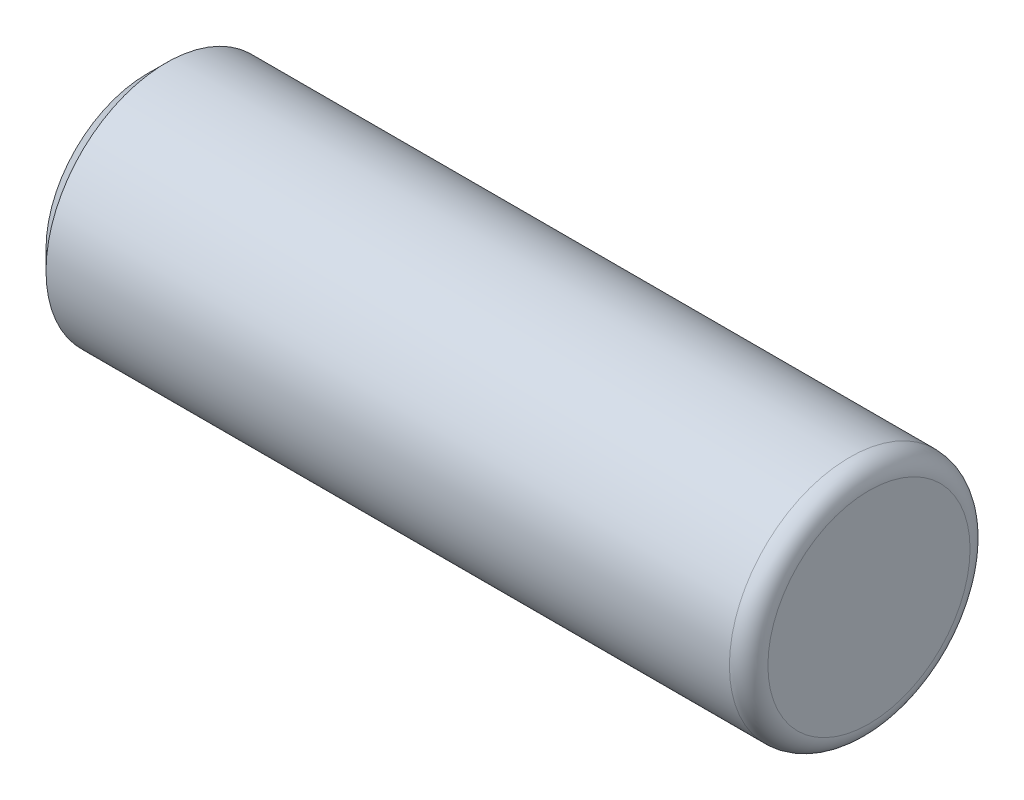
from build123d import *

# Parameters (mm, degrees)
SKETCH2_W     = 19.05
SKETCH2_H     = 3.175
CHAMFER1_SIZE = 0.508
FILLET1_R     = 0.508


with BuildPart() as part:
    # Sketch2 → Revolve1 (revolve)
    with BuildSketch(Plane.XY, mode=Mode.PRIVATE) as revolve1_sk:
        with Locations((-9.525, 1.5875)):
            Rectangle(SKETCH2_W, SKETCH2_H)
    revolve(revolve1_sk.sketch.rotate(Axis((-14.156533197, 0, 0), (1, 0, 0)), 90), axis=Axis((-14.156533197, 0, 0), (1, 0, 0)))

    # Chamfer1
    chamfer1_edges = [part.edges().sort_by_distance(p)[0] for p in [
        (-19.05, 0, -3.175),
    ]]
    chamfer(chamfer1_edges, length=CHAMFER1_SIZE)

    # Fillet1
    fillet1_edges = [part.edges().sort_by_distance(p)[0] for p in [
        (0, 0, -3.175),
    ]]
    fillet(fillet1_edges, radius=FILLET1_R)


solid = part.part
